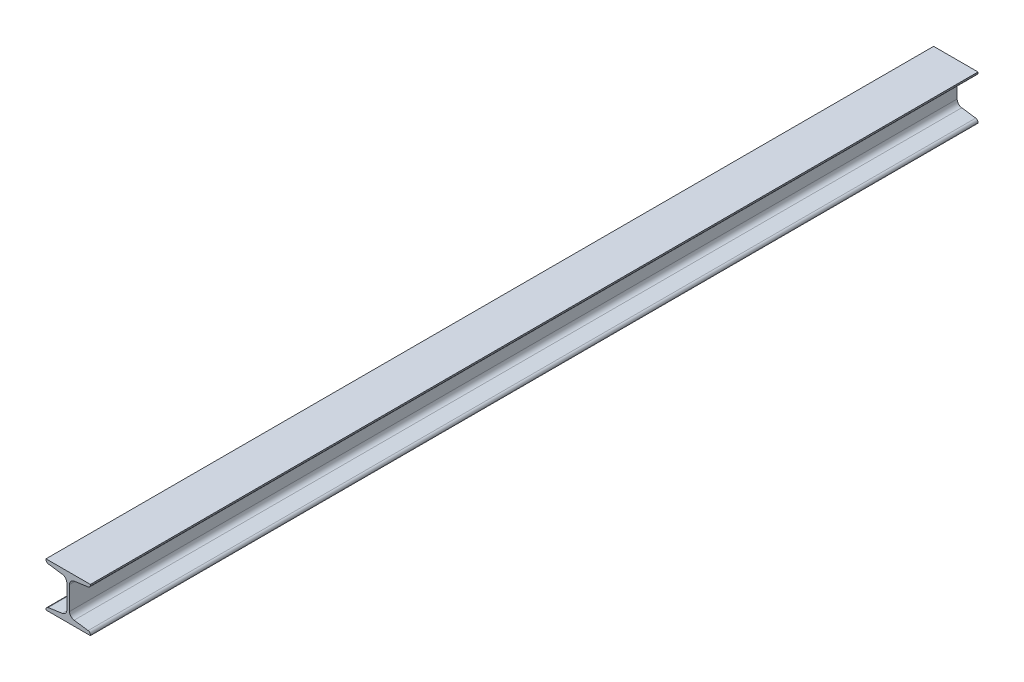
ISO-10303-21;
HEADER;
FILE_DESCRIPTION(('STEP AP214'),'2;1');
FILE_NAME('part.step','',(''),(''),'','','');
FILE_SCHEMA(('AUTOMOTIVE_DESIGN { 1 0 10303 214 1 1 1 1 }'));
ENDSEC;
DATA;
#1=APPLICATION_CONTEXT('core data for automotive mechanical design processes');
#2=APPLICATION_PROTOCOL_DEFINITION('international standard','automotive_design',2000,#1);
#3=PRODUCT_CONTEXT('',#1,'mechanical');
#4=PRODUCT('Part','Part','',(#3));
#5=PRODUCT_RELATED_PRODUCT_CATEGORY('part','',(#4));
#6=PRODUCT_DEFINITION_FORMATION('','',#4);
#7=PRODUCT_DEFINITION_CONTEXT('part definition',#1,'design');
#8=PRODUCT_DEFINITION('design','',#6,#7);
#9=PRODUCT_DEFINITION_SHAPE('','',#8);
#10=(LENGTH_UNIT() NAMED_UNIT(*) SI_UNIT(.MILLI.,.METRE.));
#11=(NAMED_UNIT(*) PLANE_ANGLE_UNIT() SI_UNIT($,.RADIAN.));
#12=(NAMED_UNIT(*) SI_UNIT($,.STERADIAN.) SOLID_ANGLE_UNIT());
#13=UNCERTAINTY_MEASURE_WITH_UNIT(LENGTH_MEASURE(1.E-05),#10,'distance_accuracy_value','');
#14=(GEOMETRIC_REPRESENTATION_CONTEXT(3) GLOBAL_UNCERTAINTY_ASSIGNED_CONTEXT((#13)) GLOBAL_UNIT_ASSIGNED_CONTEXT((#10,
#11,#12)) REPRESENTATION_CONTEXT('',''));
#15=CARTESIAN_POINT('',(0.,0.,0.));
#16=DIRECTION('',(0.,0.,1.));
#17=DIRECTION('',(1.,0.,0.));
#18=AXIS2_PLACEMENT_3D('',#15,#16,#17);
#19=CARTESIAN_POINT('',(116.713,76.2658495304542,2000.));
#20=DIRECTION('',(0.,0.,-1.));
#21=DIRECTION('',(-1.,0.,0.));
#22=AXIS2_PLACEMENT_3D('',#19,#20,#21);
#23=CYLINDRICAL_SURFACE('',#22,12.);
#24=CARTESIAN_POINT('',(116.713,76.2658495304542,0.));
#25=DIRECTION('',(0.,0.,-1.));
#26=DIRECTION('',(1.,0.,0.));
#27=AXIS2_PLACEMENT_3D('',#24,#25,#26);
#28=CIRCLE('',#27,12.);
#29=CARTESIAN_POINT('',(104.713,76.2658495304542,0.));
#30=VERTEX_POINT('',#29);
#31=CARTESIAN_POINT('',(115.042922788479,88.1490663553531,0.));
#32=VERTEX_POINT('',#31);
#33=EDGE_CURVE('E198',#30,#32,#28,.T.);
#34=ORIENTED_EDGE('',*,*,#33,.T.);
#35=DIRECTION('',(0.,0.,-1.));
#36=VECTOR('',#35,1.);
#37=CARTESIAN_POINT('',(115.042922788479,88.1490663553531,2000.));
#38=LINE('',#37,#36);
#39=CARTESIAN_POINT('',(115.042922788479,88.1490663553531,2000.));
#40=VERTEX_POINT('',#39);
#41=EDGE_CURVE('E11',#40,#32,#38,.T.);
#42=ORIENTED_EDGE('',*,*,#41,.F.);
#43=CARTESIAN_POINT('',(116.713,76.2658495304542,2000.));
#44=DIRECTION('',(0.,0.,-1.));
#45=DIRECTION('',(1.,0.,0.));
#46=AXIS2_PLACEMENT_3D('',#43,#44,#45);
#47=CIRCLE('',#46,12.);
#48=CARTESIAN_POINT('',(104.713,76.2658495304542,2000.));
#49=VERTEX_POINT('',#48);
#50=EDGE_CURVE('E236',#49,#40,#47,.T.);
#51=ORIENTED_EDGE('',*,*,#50,.F.);
#52=DIRECTION('',(0.,0.,-1.));
#53=VECTOR('',#52,1.);
#54=CARTESIAN_POINT('',(104.713,76.2658495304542,2000.));
#55=LINE('',#54,#53);
#56=EDGE_CURVE('E194',#49,#30,#55,.T.);
#57=ORIENTED_EDGE('',*,*,#56,.T.);
#58=EDGE_LOOP('',(#34,#42,#51,#57));
#59=FACE_BOUND('',#58,.T.);
#60=ADVANCED_FACE('F30',(#59),#23,.F.);
#61=CARTESIAN_POINT('',(146.54803860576,92.576821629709,2000.));
#62=DIRECTION('',(-0.139173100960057,0.990268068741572,0.));
#63=DIRECTION('',(-0.990268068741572,-0.139173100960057,0.));
#64=AXIS2_PLACEMENT_3D('',#61,#62,#63);
#65=PLANE('',#64);
#66=DIRECTION('',(0.990268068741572,0.139173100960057,0.));
#67=VECTOR('',#66,1.);
#68=CARTESIAN_POINT('',(146.54803860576,92.576821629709,0.));
#69=LINE('',#68,#67);
#70=CARTESIAN_POINT('',(146.54803860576,92.576821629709,0.));
#71=VERTEX_POINT('',#70);
#72=EDGE_CURVE('E201',#32,#71,#69,.T.);
#73=ORIENTED_EDGE('',*,*,#72,.T.);
#74=DIRECTION('',(0.,0.,-1.));
#75=VECTOR('',#74,1.);
#76=CARTESIAN_POINT('',(146.54803860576,92.576821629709,2000.));
#77=LINE('',#76,#75);
#78=CARTESIAN_POINT('',(146.54803860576,92.576821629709,2000.));
#79=VERTEX_POINT('',#78);
#80=EDGE_CURVE('E38',#79,#71,#77,.T.);
#81=ORIENTED_EDGE('',*,*,#80,.F.);
#82=DIRECTION('',(0.990268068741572,0.139173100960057,0.));
#83=VECTOR('',#82,1.);
#84=CARTESIAN_POINT('',(146.54803860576,92.576821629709,2000.));
#85=LINE('',#84,#83);
#86=EDGE_CURVE('E125',#40,#79,#85,.T.);
#87=ORIENTED_EDGE('',*,*,#86,.F.);
#88=ORIENTED_EDGE('',*,*,#41,.T.);
#89=EDGE_LOOP('',(#73,#81,#87,#88));
#90=FACE_BOUND('',#89,.T.);
#91=ADVANCED_FACE('F354',(#90),#65,.F.);
#92=CARTESIAN_POINT('',(145.713,98.5184300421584,2000.));
#93=DIRECTION('',(0.,0.,-1.));
#94=DIRECTION('',(-1.,0.,0.));
#95=AXIS2_PLACEMENT_3D('',#92,#93,#94);
#96=CYLINDRICAL_SURFACE('',#95,5.99999999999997);
#97=CARTESIAN_POINT('',(145.713,98.5184300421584,0.));
#98=DIRECTION('',(0.,0.,1.));
#99=DIRECTION('',(-1.,0.,0.));
#100=AXIS2_PLACEMENT_3D('',#97,#98,#99);
#101=CIRCLE('',#100,5.99999999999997);
#102=CARTESIAN_POINT('',(151.713,98.5184300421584,0.));
#103=VERTEX_POINT('',#102);
#104=EDGE_CURVE('E203',#71,#103,#101,.T.);
#105=ORIENTED_EDGE('',*,*,#104,.T.);
#106=DIRECTION('',(0.,0.,-1.));
#107=VECTOR('',#106,1.);
#108=CARTESIAN_POINT('',(151.713,98.5184300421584,2000.));
#109=LINE('',#108,#107);
#110=CARTESIAN_POINT('',(151.713,98.5184300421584,2000.));
#111=VERTEX_POINT('',#110);
#112=EDGE_CURVE('E279',#111,#103,#109,.T.);
#113=ORIENTED_EDGE('',*,*,#112,.F.);
#114=CARTESIAN_POINT('',(145.713,98.5184300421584,2000.));
#115=DIRECTION('',(0.,0.,1.));
#116=DIRECTION('',(-1.,0.,0.));
#117=AXIS2_PLACEMENT_3D('',#114,#115,#116);
#118=CIRCLE('',#117,5.99999999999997);
#119=EDGE_CURVE('E287',#79,#111,#118,.T.);
#120=ORIENTED_EDGE('',*,*,#119,.F.);
#121=ORIENTED_EDGE('',*,*,#80,.T.);
#122=EDGE_LOOP('',(#105,#113,#120,#121));
#123=FACE_BOUND('',#122,.T.);
#124=ADVANCED_FACE('F285',(#123),#96,.T.);
#125=CARTESIAN_POINT('',(151.713,100.,2000.));
#126=DIRECTION('',(-1.,0.,0.));
#127=DIRECTION('',(0.,0.,1.));
#128=AXIS2_PLACEMENT_3D('',#125,#126,#127);
#129=PLANE('',#128);
#130=DIRECTION('',(0.,1.,0.));
#131=VECTOR('',#130,1.);
#132=CARTESIAN_POINT('',(151.713,100.,0.));
#133=LINE('',#132,#131);
#134=CARTESIAN_POINT('',(151.713,100.,0.));
#135=VERTEX_POINT('',#134);
#136=EDGE_CURVE('E205',#103,#135,#133,.T.);
#137=ORIENTED_EDGE('',*,*,#136,.T.);
#138=DIRECTION('',(0.,0.,-1.));
#139=VECTOR('',#138,1.);
#140=CARTESIAN_POINT('',(151.713,100.,2000.));
#141=LINE('',#140,#139);
#142=CARTESIAN_POINT('',(151.713,100.,2000.));
#143=VERTEX_POINT('',#142);
#144=EDGE_CURVE('E276',#143,#135,#141,.T.);
#145=ORIENTED_EDGE('',*,*,#144,.F.);
#146=DIRECTION('',(0.,1.,0.));
#147=VECTOR('',#146,1.);
#148=CARTESIAN_POINT('',(151.713,100.,2000.));
#149=LINE('',#148,#147);
#150=EDGE_CURVE('E305',#111,#143,#149,.T.);
#151=ORIENTED_EDGE('',*,*,#150,.F.);
#152=ORIENTED_EDGE('',*,*,#112,.T.);
#153=EDGE_LOOP('',(#137,#145,#151,#152));
#154=FACE_BOUND('',#153,.T.);
#155=ADVANCED_FACE('F296',(#154),#129,.F.);
#156=CARTESIAN_POINT('',(51.713,100.,2000.));
#157=DIRECTION('',(0.,-1.,0.));
#158=DIRECTION('',(0.,0.,-1.));
#159=AXIS2_PLACEMENT_3D('',#156,#157,#158);
#160=PLANE('',#159);
#161=DIRECTION('',(-1.,0.,0.));
#162=VECTOR('',#161,1.);
#163=CARTESIAN_POINT('',(51.713,100.,0.));
#164=LINE('',#163,#162);
#165=CARTESIAN_POINT('',(51.713,100.,0.));
#166=VERTEX_POINT('',#165);
#167=EDGE_CURVE('E207',#135,#166,#164,.T.);
#168=ORIENTED_EDGE('',*,*,#167,.T.);
#169=DIRECTION('',(0.,0.,-1.));
#170=VECTOR('',#169,1.);
#171=CARTESIAN_POINT('',(51.713,100.,2000.));
#172=LINE('',#171,#170);
#173=CARTESIAN_POINT('',(51.713,100.,2000.));
#174=VERTEX_POINT('',#173);
#175=EDGE_CURVE('E273',#174,#166,#172,.T.);
#176=ORIENTED_EDGE('',*,*,#175,.F.);
#177=DIRECTION('',(-1.,0.,0.));
#178=VECTOR('',#177,1.);
#179=CARTESIAN_POINT('',(51.713,100.,2000.));
#180=LINE('',#179,#178);
#181=EDGE_CURVE('E302',#143,#174,#180,.T.);
#182=ORIENTED_EDGE('',*,*,#181,.F.);
#183=ORIENTED_EDGE('',*,*,#144,.T.);
#184=EDGE_LOOP('',(#168,#176,#182,#183));
#185=FACE_BOUND('',#184,.T.);
#186=ADVANCED_FACE('F300',(#185),#160,.F.);
#187=CARTESIAN_POINT('',(51.713,98.5184300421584,2000.));
#188=DIRECTION('',(1.,0.,0.));
#189=DIRECTION('',(0.,0.,-1.));
#190=AXIS2_PLACEMENT_3D('',#187,#188,#189);
#191=PLANE('',#190);
#192=DIRECTION('',(0.,-1.,0.));
#193=VECTOR('',#192,1.);
#194=CARTESIAN_POINT('',(51.713,98.5184300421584,0.));
#195=LINE('',#194,#193);
#196=CARTESIAN_POINT('',(51.713,98.5184300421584,0.));
#197=VERTEX_POINT('',#196);
#198=EDGE_CURVE('E209',#166,#197,#195,.T.);
#199=ORIENTED_EDGE('',*,*,#198,.T.);
#200=DIRECTION('',(0.,0.,-1.));
#201=VECTOR('',#200,1.);
#202=CARTESIAN_POINT('',(51.713,98.5184300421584,2000.));
#203=LINE('',#202,#201);
#204=CARTESIAN_POINT('',(51.713,98.5184300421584,2000.));
#205=VERTEX_POINT('',#204);
#206=EDGE_CURVE('E270',#205,#197,#203,.T.);
#207=ORIENTED_EDGE('',*,*,#206,.F.);
#208=DIRECTION('',(0.,-1.,0.));
#209=VECTOR('',#208,1.);
#210=CARTESIAN_POINT('',(51.713,98.5184300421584,2000.));
#211=LINE('',#210,#209);
#212=EDGE_CURVE('E304',#174,#205,#211,.T.);
#213=ORIENTED_EDGE('',*,*,#212,.F.);
#214=ORIENTED_EDGE('',*,*,#175,.T.);
#215=EDGE_LOOP('',(#199,#207,#213,#214));
#216=FACE_BOUND('',#215,.T.);
#217=ADVANCED_FACE('F367',(#216),#191,.F.);
#218=CARTESIAN_POINT('',(57.713,98.5184300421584,2000.));
#219=DIRECTION('',(0.,0.,-1.));
#220=DIRECTION('',(-1.,0.,0.));
#221=AXIS2_PLACEMENT_3D('',#218,#219,#220);
#222=CYLINDRICAL_SURFACE('',#221,5.99999999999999);
#223=CARTESIAN_POINT('',(57.713,98.5184300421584,0.));
#224=DIRECTION('',(0.,0.,1.));
#225=DIRECTION('',(1.,0.,0.));
#226=AXIS2_PLACEMENT_3D('',#223,#224,#225);
#227=CIRCLE('',#226,5.99999999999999);
#228=CARTESIAN_POINT('',(56.8779613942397,92.576821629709,0.));
#229=VERTEX_POINT('',#228);
#230=EDGE_CURVE('E211',#197,#229,#227,.T.);
#231=ORIENTED_EDGE('',*,*,#230,.T.);
#232=DIRECTION('',(0.,0.,-1.));
#233=VECTOR('',#232,1.);
#234=CARTESIAN_POINT('',(56.8779613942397,92.576821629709,2000.));
#235=LINE('',#234,#233);
#236=CARTESIAN_POINT('',(56.8779613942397,92.576821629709,2000.));
#237=VERTEX_POINT('',#236);
#238=EDGE_CURVE('E267',#237,#229,#235,.T.);
#239=ORIENTED_EDGE('',*,*,#238,.F.);
#240=CARTESIAN_POINT('',(57.713,98.5184300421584,2000.));
#241=DIRECTION('',(0.,0.,1.));
#242=DIRECTION('',(1.,0.,0.));
#243=AXIS2_PLACEMENT_3D('',#240,#241,#242);
#244=CIRCLE('',#243,5.99999999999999);
#245=EDGE_CURVE('E307',#205,#237,#244,.T.);
#246=ORIENTED_EDGE('',*,*,#245,.F.);
#247=ORIENTED_EDGE('',*,*,#206,.T.);
#248=EDGE_LOOP('',(#231,#239,#246,#247));
#249=FACE_BOUND('',#248,.T.);
#250=ADVANCED_FACE('F370',(#249),#222,.T.);
#251=CARTESIAN_POINT('',(88.3830772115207,88.1490663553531,2000.));
#252=DIRECTION('',(0.139173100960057,0.990268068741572,0.));
#253=DIRECTION('',(-0.990268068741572,0.139173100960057,0.));
#254=AXIS2_PLACEMENT_3D('',#251,#252,#253);
#255=PLANE('',#254);
#256=DIRECTION('',(0.990268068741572,-0.139173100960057,0.));
#257=VECTOR('',#256,1.);
#258=CARTESIAN_POINT('',(88.3830772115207,88.1490663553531,0.));
#259=LINE('',#258,#257);
#260=CARTESIAN_POINT('',(88.3830772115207,88.1490663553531,0.));
#261=VERTEX_POINT('',#260);
#262=EDGE_CURVE('E213',#229,#261,#259,.T.);
#263=ORIENTED_EDGE('',*,*,#262,.T.);
#264=DIRECTION('',(0.,0.,-1.));
#265=VECTOR('',#264,1.);
#266=CARTESIAN_POINT('',(88.3830772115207,88.1490663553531,2000.));
#267=LINE('',#266,#265);
#268=CARTESIAN_POINT('',(88.3830772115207,88.1490663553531,2000.));
#269=VERTEX_POINT('',#268);
#270=EDGE_CURVE('E264',#269,#261,#267,.T.);
#271=ORIENTED_EDGE('',*,*,#270,.F.);
#272=DIRECTION('',(0.990268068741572,-0.139173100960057,0.));
#273=VECTOR('',#272,1.);
#274=CARTESIAN_POINT('',(88.3830772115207,88.1490663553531,2000.));
#275=LINE('',#274,#273);
#276=EDGE_CURVE('E313',#237,#269,#275,.T.);
#277=ORIENTED_EDGE('',*,*,#276,.F.);
#278=ORIENTED_EDGE('',*,*,#238,.T.);
#279=EDGE_LOOP('',(#263,#271,#277,#278));
#280=FACE_BOUND('',#279,.T.);
#281=ADVANCED_FACE('F374',(#280),#255,.F.);
#282=CARTESIAN_POINT('',(86.713,76.2658495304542,2000.));
#283=DIRECTION('',(0.,0.,-1.));
#284=DIRECTION('',(-1.,0.,0.));
#285=AXIS2_PLACEMENT_3D('',#282,#283,#284);
#286=CYLINDRICAL_SURFACE('',#285,12.);
#287=CARTESIAN_POINT('',(86.713,76.2658495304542,0.));
#288=DIRECTION('',(0.,0.,-1.));
#289=DIRECTION('',(1.,0.,0.));
#290=AXIS2_PLACEMENT_3D('',#287,#288,#289);
#291=CIRCLE('',#290,12.);
#292=CARTESIAN_POINT('',(98.713,76.2658495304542,0.));
#293=VERTEX_POINT('',#292);
#294=EDGE_CURVE('E215',#261,#293,#291,.T.);
#295=ORIENTED_EDGE('',*,*,#294,.T.);
#296=DIRECTION('',(0.,0.,-1.));
#297=VECTOR('',#296,1.);
#298=CARTESIAN_POINT('',(98.713,76.2658495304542,2000.));
#299=LINE('',#298,#297);
#300=CARTESIAN_POINT('',(98.713,76.2658495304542,2000.));
#301=VERTEX_POINT('',#300);
#302=EDGE_CURVE('E261',#301,#293,#299,.T.);
#303=ORIENTED_EDGE('',*,*,#302,.F.);
#304=CARTESIAN_POINT('',(86.713,76.2658495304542,2000.));
#305=DIRECTION('',(0.,0.,-1.));
#306=DIRECTION('',(1.,0.,0.));
#307=AXIS2_PLACEMENT_3D('',#304,#305,#306);
#308=CIRCLE('',#307,12.);
#309=EDGE_CURVE('E315',#269,#301,#308,.T.);
#310=ORIENTED_EDGE('',*,*,#309,.F.);
#311=ORIENTED_EDGE('',*,*,#270,.T.);
#312=EDGE_LOOP('',(#295,#303,#310,#311));
#313=FACE_BOUND('',#312,.T.);
#314=ADVANCED_FACE('F378',(#313),#286,.F.);
#315=CARTESIAN_POINT('',(98.713,23.7341504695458,2000.));
#316=DIRECTION('',(1.,0.,0.));
#317=DIRECTION('',(0.,0.,-1.));
#318=AXIS2_PLACEMENT_3D('',#315,#316,#317);
#319=PLANE('',#318);
#320=DIRECTION('',(0.,-1.,0.));
#321=VECTOR('',#320,1.);
#322=CARTESIAN_POINT('',(98.713,23.7341504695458,0.));
#323=LINE('',#322,#321);
#324=CARTESIAN_POINT('',(98.713,23.7341504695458,0.));
#325=VERTEX_POINT('',#324);
#326=EDGE_CURVE('E217',#293,#325,#323,.T.);
#327=ORIENTED_EDGE('',*,*,#326,.T.);
#328=DIRECTION('',(0.,0.,-1.));
#329=VECTOR('',#328,1.);
#330=CARTESIAN_POINT('',(98.713,23.7341504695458,2000.));
#331=LINE('',#330,#329);
#332=CARTESIAN_POINT('',(98.713,23.7341504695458,2000.));
#333=VERTEX_POINT('',#332);
#334=EDGE_CURVE('E258',#333,#325,#331,.T.);
#335=ORIENTED_EDGE('',*,*,#334,.F.);
#336=DIRECTION('',(0.,-1.,0.));
#337=VECTOR('',#336,1.);
#338=CARTESIAN_POINT('',(98.713,23.7341504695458,2000.));
#339=LINE('',#338,#337);
#340=EDGE_CURVE('E317',#301,#333,#339,.T.);
#341=ORIENTED_EDGE('',*,*,#340,.F.);
#342=ORIENTED_EDGE('',*,*,#302,.T.);
#343=EDGE_LOOP('',(#327,#335,#341,#342));
#344=FACE_BOUND('',#343,.T.);
#345=ADVANCED_FACE('F382',(#344),#319,.F.);
#346=CARTESIAN_POINT('',(86.713,23.7341504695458,2000.));
#347=DIRECTION('',(0.,0.,-1.));
#348=DIRECTION('',(-1.,0.,0.));
#349=AXIS2_PLACEMENT_3D('',#346,#347,#348);
#350=CYLINDRICAL_SURFACE('',#349,12.);
#351=CARTESIAN_POINT('',(86.713,23.7341504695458,0.));
#352=DIRECTION('',(0.,0.,-1.));
#353=DIRECTION('',(1.,0.,0.));
#354=AXIS2_PLACEMENT_3D('',#351,#352,#353);
#355=CIRCLE('',#354,12.);
#356=CARTESIAN_POINT('',(88.3830772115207,11.8509336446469,0.));
#357=VERTEX_POINT('',#356);
#358=EDGE_CURVE('E219',#325,#357,#355,.T.);
#359=ORIENTED_EDGE('',*,*,#358,.T.);
#360=DIRECTION('',(0.,0.,-1.));
#361=VECTOR('',#360,1.);
#362=CARTESIAN_POINT('',(88.3830772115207,11.8509336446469,2000.));
#363=LINE('',#362,#361);
#364=CARTESIAN_POINT('',(88.3830772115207,11.8509336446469,2000.));
#365=VERTEX_POINT('',#364);
#366=EDGE_CURVE('E255',#365,#357,#363,.T.);
#367=ORIENTED_EDGE('',*,*,#366,.F.);
#368=CARTESIAN_POINT('',(86.713,23.7341504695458,2000.));
#369=DIRECTION('',(0.,0.,-1.));
#370=DIRECTION('',(1.,0.,0.));
#371=AXIS2_PLACEMENT_3D('',#368,#369,#370);
#372=CIRCLE('',#371,12.);
#373=EDGE_CURVE('E319',#333,#365,#372,.T.);
#374=ORIENTED_EDGE('',*,*,#373,.F.);
#375=ORIENTED_EDGE('',*,*,#334,.T.);
#376=EDGE_LOOP('',(#359,#367,#374,#375));
#377=FACE_BOUND('',#376,.T.);
#378=ADVANCED_FACE('F386',(#377),#350,.F.);
#379=CARTESIAN_POINT('',(56.8779613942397,7.42317837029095,2000.));
#380=DIRECTION('',(0.139173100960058,-0.990268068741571,0.));
#381=DIRECTION('',(0.990268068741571,0.139173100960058,0.));
#382=AXIS2_PLACEMENT_3D('',#379,#380,#381);
#383=PLANE('',#382);
#384=DIRECTION('',(-0.990268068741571,-0.139173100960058,0.));
#385=VECTOR('',#384,1.);
#386=CARTESIAN_POINT('',(56.8779613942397,7.42317837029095,0.));
#387=LINE('',#386,#385);
#388=CARTESIAN_POINT('',(56.8779613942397,7.42317837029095,0.));
#389=VERTEX_POINT('',#388);
#390=EDGE_CURVE('E221',#357,#389,#387,.T.);
#391=ORIENTED_EDGE('',*,*,#390,.T.);
#392=DIRECTION('',(0.,0.,-1.));
#393=VECTOR('',#392,1.);
#394=CARTESIAN_POINT('',(56.8779613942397,7.42317837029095,2000.));
#395=LINE('',#394,#393);
#396=CARTESIAN_POINT('',(56.8779613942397,7.42317837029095,2000.));
#397=VERTEX_POINT('',#396);
#398=EDGE_CURVE('E252',#397,#389,#395,.T.);
#399=ORIENTED_EDGE('',*,*,#398,.F.);
#400=DIRECTION('',(-0.990268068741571,-0.139173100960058,0.));
#401=VECTOR('',#400,1.);
#402=CARTESIAN_POINT('',(56.8779613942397,7.42317837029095,2000.));
#403=LINE('',#402,#401);
#404=EDGE_CURVE('E321',#365,#397,#403,.T.);
#405=ORIENTED_EDGE('',*,*,#404,.F.);
#406=ORIENTED_EDGE('',*,*,#366,.T.);
#407=EDGE_LOOP('',(#391,#399,#405,#406));
#408=FACE_BOUND('',#407,.T.);
#409=ADVANCED_FACE('F390',(#408),#383,.F.);
#410=CARTESIAN_POINT('',(57.713,1.48156995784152,2000.));
#411=DIRECTION('',(0.,0.,-1.));
#412=DIRECTION('',(-1.,0.,0.));
#413=AXIS2_PLACEMENT_3D('',#410,#411,#412);
#414=CYLINDRICAL_SURFACE('',#413,6.);
#415=CARTESIAN_POINT('',(57.713,1.48156995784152,0.));
#416=DIRECTION('',(0.,0.,1.));
#417=DIRECTION('',(-1.,0.,0.));
#418=AXIS2_PLACEMENT_3D('',#415,#416,#417);
#419=CIRCLE('',#418,6.);
#420=CARTESIAN_POINT('',(51.713,1.48156995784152,0.));
#421=VERTEX_POINT('',#420);
#422=EDGE_CURVE('E223',#389,#421,#419,.T.);
#423=ORIENTED_EDGE('',*,*,#422,.T.);
#424=DIRECTION('',(0.,0.,-1.));
#425=VECTOR('',#424,1.);
#426=CARTESIAN_POINT('',(51.713,1.48156995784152,2000.));
#427=LINE('',#426,#425);
#428=CARTESIAN_POINT('',(51.713,1.48156995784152,2000.));
#429=VERTEX_POINT('',#428);
#430=EDGE_CURVE('E249',#429,#421,#427,.T.);
#431=ORIENTED_EDGE('',*,*,#430,.F.);
#432=CARTESIAN_POINT('',(57.713,1.48156995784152,2000.));
#433=DIRECTION('',(0.,0.,1.));
#434=DIRECTION('',(-1.,0.,0.));
#435=AXIS2_PLACEMENT_3D('',#432,#433,#434);
#436=CIRCLE('',#435,6.);
#437=EDGE_CURVE('E323',#397,#429,#436,.T.);
#438=ORIENTED_EDGE('',*,*,#437,.F.);
#439=ORIENTED_EDGE('',*,*,#398,.T.);
#440=EDGE_LOOP('',(#423,#431,#438,#439));
#441=FACE_BOUND('',#440,.T.);
#442=ADVANCED_FACE('F394',(#441),#414,.T.);
#443=CARTESIAN_POINT('',(51.713,0.,2000.));
#444=DIRECTION('',(1.,0.,0.));
#445=DIRECTION('',(0.,0.,-1.));
#446=AXIS2_PLACEMENT_3D('',#443,#444,#445);
#447=PLANE('',#446);
#448=DIRECTION('',(0.,-1.,0.));
#449=VECTOR('',#448,1.);
#450=CARTESIAN_POINT('',(51.713,0.,0.));
#451=LINE('',#450,#449);
#452=CARTESIAN_POINT('',(51.713,0.,0.));
#453=VERTEX_POINT('',#452);
#454=EDGE_CURVE('E225',#421,#453,#451,.T.);
#455=ORIENTED_EDGE('',*,*,#454,.T.);
#456=DIRECTION('',(0.,0.,-1.));
#457=VECTOR('',#456,1.);
#458=CARTESIAN_POINT('',(51.713,0.,2000.));
#459=LINE('',#458,#457);
#460=CARTESIAN_POINT('',(51.713,0.,2000.));
#461=VERTEX_POINT('',#460);
#462=EDGE_CURVE('E246',#461,#453,#459,.T.);
#463=ORIENTED_EDGE('',*,*,#462,.F.);
#464=DIRECTION('',(0.,-1.,0.));
#465=VECTOR('',#464,1.);
#466=CARTESIAN_POINT('',(51.713,0.,2000.));
#467=LINE('',#466,#465);
#468=EDGE_CURVE('E325',#429,#461,#467,.T.);
#469=ORIENTED_EDGE('',*,*,#468,.F.);
#470=ORIENTED_EDGE('',*,*,#430,.T.);
#471=EDGE_LOOP('',(#455,#463,#469,#470));
#472=FACE_BOUND('',#471,.T.);
#473=ADVANCED_FACE('F398',(#472),#447,.F.);
#474=CARTESIAN_POINT('',(151.713,0.,2000.));
#475=DIRECTION('',(0.,1.,0.));
#476=DIRECTION('',(0.,0.,1.));
#477=AXIS2_PLACEMENT_3D('',#474,#475,#476);
#478=PLANE('',#477);
#479=DIRECTION('',(1.,0.,0.));
#480=VECTOR('',#479,1.);
#481=CARTESIAN_POINT('',(151.713,0.,0.));
#482=LINE('',#481,#480);
#483=CARTESIAN_POINT('',(151.713,0.,0.));
#484=VERTEX_POINT('',#483);
#485=EDGE_CURVE('E227',#453,#484,#482,.T.);
#486=ORIENTED_EDGE('',*,*,#485,.T.);
#487=DIRECTION('',(0.,0.,-1.));
#488=VECTOR('',#487,1.);
#489=CARTESIAN_POINT('',(151.713,0.,2000.));
#490=LINE('',#489,#488);
#491=CARTESIAN_POINT('',(151.713,0.,2000.));
#492=VERTEX_POINT('',#491);
#493=EDGE_CURVE('E243',#492,#484,#490,.T.);
#494=ORIENTED_EDGE('',*,*,#493,.F.);
#495=DIRECTION('',(1.,0.,0.));
#496=VECTOR('',#495,1.);
#497=CARTESIAN_POINT('',(151.713,0.,2000.));
#498=LINE('',#497,#496);
#499=EDGE_CURVE('E327',#461,#492,#498,.T.);
#500=ORIENTED_EDGE('',*,*,#499,.F.);
#501=ORIENTED_EDGE('',*,*,#462,.T.);
#502=EDGE_LOOP('',(#486,#494,#500,#501));
#503=FACE_BOUND('',#502,.T.);
#504=ADVANCED_FACE('F402',(#503),#478,.F.);
#505=CARTESIAN_POINT('',(151.713,1.48156995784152,2000.));
#506=DIRECTION('',(-1.,0.,0.));
#507=DIRECTION('',(0.,0.,1.));
#508=AXIS2_PLACEMENT_3D('',#505,#506,#507);
#509=PLANE('',#508);
#510=DIRECTION('',(0.,1.,0.));
#511=VECTOR('',#510,1.);
#512=CARTESIAN_POINT('',(151.713,1.48156995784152,0.));
#513=LINE('',#512,#511);
#514=CARTESIAN_POINT('',(151.713,1.48156995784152,0.));
#515=VERTEX_POINT('',#514);
#516=EDGE_CURVE('E229',#484,#515,#513,.T.);
#517=ORIENTED_EDGE('',*,*,#516,.T.);
#518=DIRECTION('',(0.,0.,-1.));
#519=VECTOR('',#518,1.);
#520=CARTESIAN_POINT('',(151.713,1.48156995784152,2000.));
#521=LINE('',#520,#519);
#522=CARTESIAN_POINT('',(151.713,1.48156995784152,2000.));
#523=VERTEX_POINT('',#522);
#524=EDGE_CURVE('E240',#523,#515,#521,.T.);
#525=ORIENTED_EDGE('',*,*,#524,.F.);
#526=DIRECTION('',(0.,1.,0.));
#527=VECTOR('',#526,1.);
#528=CARTESIAN_POINT('',(151.713,1.48156995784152,2000.));
#529=LINE('',#528,#527);
#530=EDGE_CURVE('E329',#492,#523,#529,.T.);
#531=ORIENTED_EDGE('',*,*,#530,.F.);
#532=ORIENTED_EDGE('',*,*,#493,.T.);
#533=EDGE_LOOP('',(#517,#525,#531,#532));
#534=FACE_BOUND('',#533,.T.);
#535=ADVANCED_FACE('F335',(#534),#509,.F.);
#536=CARTESIAN_POINT('',(145.713,1.48156995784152,2000.));
#537=DIRECTION('',(0.,0.,-1.));
#538=DIRECTION('',(-1.,0.,0.));
#539=AXIS2_PLACEMENT_3D('',#536,#537,#538);
#540=CYLINDRICAL_SURFACE('',#539,5.99999999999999);
#541=CARTESIAN_POINT('',(145.713,1.48156995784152,0.));
#542=DIRECTION('',(0.,0.,1.));
#543=DIRECTION('',(1.,0.,0.));
#544=AXIS2_PLACEMENT_3D('',#541,#542,#543);
#545=CIRCLE('',#544,5.99999999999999);
#546=CARTESIAN_POINT('',(146.54803860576,7.42317837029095,0.));
#547=VERTEX_POINT('',#546);
#548=EDGE_CURVE('E231',#515,#547,#545,.T.);
#549=ORIENTED_EDGE('',*,*,#548,.T.);
#550=DIRECTION('',(0.,0.,-1.));
#551=VECTOR('',#550,1.);
#552=CARTESIAN_POINT('',(146.54803860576,7.42317837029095,2000.));
#553=LINE('',#552,#551);
#554=CARTESIAN_POINT('',(146.54803860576,7.42317837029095,2000.));
#555=VERTEX_POINT('',#554);
#556=EDGE_CURVE('E189',#555,#547,#553,.T.);
#557=ORIENTED_EDGE('',*,*,#556,.F.);
#558=CARTESIAN_POINT('',(145.713,1.48156995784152,2000.));
#559=DIRECTION('',(0.,0.,1.));
#560=DIRECTION('',(1.,0.,0.));
#561=AXIS2_PLACEMENT_3D('',#558,#559,#560);
#562=CIRCLE('',#561,5.99999999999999);
#563=EDGE_CURVE('E180',#523,#555,#562,.T.);
#564=ORIENTED_EDGE('',*,*,#563,.F.);
#565=ORIENTED_EDGE('',*,*,#524,.T.);
#566=EDGE_LOOP('',(#549,#557,#564,#565));
#567=FACE_BOUND('',#566,.T.);
#568=ADVANCED_FACE('F339',(#567),#540,.T.);
#569=CARTESIAN_POINT('',(115.042922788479,11.8509336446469,2000.));
#570=DIRECTION('',(-0.139173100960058,-0.990268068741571,0.));
#571=DIRECTION('',(0.990268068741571,-0.139173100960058,0.));
#572=AXIS2_PLACEMENT_3D('',#569,#570,#571);
#573=PLANE('',#572);
#574=DIRECTION('',(-0.990268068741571,0.139173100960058,0.));
#575=VECTOR('',#574,1.);
#576=CARTESIAN_POINT('',(115.042922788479,11.8509336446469,0.));
#577=LINE('',#576,#575);
#578=CARTESIAN_POINT('',(115.042922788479,11.8509336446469,0.));
#579=VERTEX_POINT('',#578);
#580=EDGE_CURVE('E188',#547,#579,#577,.T.);
#581=ORIENTED_EDGE('',*,*,#580,.T.);
#582=DIRECTION('',(0.,0.,-1.));
#583=VECTOR('',#582,1.);
#584=CARTESIAN_POINT('',(115.042922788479,11.8509336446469,2000.));
#585=LINE('',#584,#583);
#586=CARTESIAN_POINT('',(115.042922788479,11.8509336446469,2000.));
#587=VERTEX_POINT('',#586);
#588=EDGE_CURVE('E185',#587,#579,#585,.T.);
#589=ORIENTED_EDGE('',*,*,#588,.F.);
#590=DIRECTION('',(-0.990268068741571,0.139173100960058,0.));
#591=VECTOR('',#590,1.);
#592=CARTESIAN_POINT('',(115.042922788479,11.8509336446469,2000.));
#593=LINE('',#592,#591);
#594=EDGE_CURVE('E174',#555,#587,#593,.T.);
#595=ORIENTED_EDGE('',*,*,#594,.F.);
#596=ORIENTED_EDGE('',*,*,#556,.T.);
#597=EDGE_LOOP('',(#581,#589,#595,#596));
#598=FACE_BOUND('',#597,.T.);
#599=ADVANCED_FACE('F186',(#598),#573,.F.);
#600=CARTESIAN_POINT('',(116.713,23.7341504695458,2000.));
#601=DIRECTION('',(0.,0.,-1.));
#602=DIRECTION('',(-1.,0.,0.));
#603=AXIS2_PLACEMENT_3D('',#600,#601,#602);
#604=CYLINDRICAL_SURFACE('',#603,12.);
#605=CARTESIAN_POINT('',(116.713,23.7341504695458,0.));
#606=DIRECTION('',(0.,0.,-1.));
#607=DIRECTION('',(1.,0.,0.));
#608=AXIS2_PLACEMENT_3D('',#605,#606,#607);
#609=CIRCLE('',#608,12.);
#610=CARTESIAN_POINT('',(104.713,23.7341504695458,0.));
#611=VERTEX_POINT('',#610);
#612=EDGE_CURVE('E111',#579,#611,#609,.T.);
#613=ORIENTED_EDGE('',*,*,#612,.T.);
#614=DIRECTION('',(0.,0.,-1.));
#615=VECTOR('',#614,1.);
#616=CARTESIAN_POINT('',(104.713,23.7341504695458,2000.));
#617=LINE('',#616,#615);
#618=CARTESIAN_POINT('',(104.713,23.7341504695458,2000.));
#619=VERTEX_POINT('',#618);
#620=EDGE_CURVE('E190',#619,#611,#617,.T.);
#621=ORIENTED_EDGE('',*,*,#620,.F.);
#622=CARTESIAN_POINT('',(116.713,23.7341504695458,2000.));
#623=DIRECTION('',(0.,0.,-1.));
#624=DIRECTION('',(1.,0.,0.));
#625=AXIS2_PLACEMENT_3D('',#622,#623,#624);
#626=CIRCLE('',#625,12.);
#627=EDGE_CURVE('E178',#587,#619,#626,.T.);
#628=ORIENTED_EDGE('',*,*,#627,.F.);
#629=ORIENTED_EDGE('',*,*,#588,.T.);
#630=EDGE_LOOP('',(#613,#621,#628,#629));
#631=FACE_BOUND('',#630,.T.);
#632=ADVANCED_FACE('F192',(#631),#604,.F.);
#633=CARTESIAN_POINT('',(104.713,76.2658495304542,2000.));
#634=DIRECTION('',(-1.,0.,0.));
#635=DIRECTION('',(0.,0.,1.));
#636=AXIS2_PLACEMENT_3D('',#633,#634,#635);
#637=PLANE('',#636);
#638=DIRECTION('',(0.,1.,0.));
#639=VECTOR('',#638,1.);
#640=CARTESIAN_POINT('',(104.713,76.2658495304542,0.));
#641=LINE('',#640,#639);
#642=EDGE_CURVE('E117',#611,#30,#641,.T.);
#643=ORIENTED_EDGE('',*,*,#642,.T.);
#644=ORIENTED_EDGE('',*,*,#56,.F.);
#645=DIRECTION('',(0.,1.,0.));
#646=VECTOR('',#645,1.);
#647=CARTESIAN_POINT('',(104.713,76.2658495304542,2000.));
#648=LINE('',#647,#646);
#649=EDGE_CURVE('E46',#619,#49,#648,.T.);
#650=ORIENTED_EDGE('',*,*,#649,.F.);
#651=ORIENTED_EDGE('',*,*,#620,.T.);
#652=EDGE_LOOP('',(#643,#644,#650,#651));
#653=FACE_BOUND('',#652,.T.);
#654=ADVANCED_FACE('F343',(#653),#637,.F.);
#655=CARTESIAN_POINT('',(116.713,76.2658495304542,2000.));
#656=DIRECTION('',(0.,0.,1.));
#657=DIRECTION('',(1.,0.,0.));
#658=AXIS2_PLACEMENT_3D('',#655,#656,#657);
#659=PLANE('',#658);
#660=ORIENTED_EDGE('',*,*,#50,.T.);
#661=ORIENTED_EDGE('',*,*,#86,.T.);
#662=ORIENTED_EDGE('',*,*,#119,.T.);
#663=ORIENTED_EDGE('',*,*,#150,.T.);
#664=ORIENTED_EDGE('',*,*,#181,.T.);
#665=ORIENTED_EDGE('',*,*,#212,.T.);
#666=ORIENTED_EDGE('',*,*,#245,.T.);
#667=ORIENTED_EDGE('',*,*,#276,.T.);
#668=ORIENTED_EDGE('',*,*,#309,.T.);
#669=ORIENTED_EDGE('',*,*,#340,.T.);
#670=ORIENTED_EDGE('',*,*,#373,.T.);
#671=ORIENTED_EDGE('',*,*,#404,.T.);
#672=ORIENTED_EDGE('',*,*,#437,.T.);
#673=ORIENTED_EDGE('',*,*,#468,.T.);
#674=ORIENTED_EDGE('',*,*,#499,.T.);
#675=ORIENTED_EDGE('',*,*,#530,.T.);
#676=ORIENTED_EDGE('',*,*,#563,.T.);
#677=ORIENTED_EDGE('',*,*,#594,.T.);
#678=ORIENTED_EDGE('',*,*,#627,.T.);
#679=ORIENTED_EDGE('',*,*,#649,.T.);
#680=EDGE_LOOP('',(#660,#661,#662,#663,#664,#665,#666,#667,#668,#669,#670,#671,#672,#673,#674,
#675,#676,#677,#678,#679));
#681=FACE_BOUND('',#680,.T.);
#682=ADVANCED_FACE('F176',(#681),#659,.T.);
#683=CARTESIAN_POINT('',(116.713,76.2658495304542,0.));
#684=DIRECTION('',(0.,0.,1.));
#685=DIRECTION('',(1.,0.,0.));
#686=AXIS2_PLACEMENT_3D('',#683,#684,#685);
#687=PLANE('',#686);
#688=ORIENTED_EDGE('',*,*,#33,.F.);
#689=ORIENTED_EDGE('',*,*,#642,.F.);
#690=ORIENTED_EDGE('',*,*,#612,.F.);
#691=ORIENTED_EDGE('',*,*,#580,.F.);
#692=ORIENTED_EDGE('',*,*,#548,.F.);
#693=ORIENTED_EDGE('',*,*,#516,.F.);
#694=ORIENTED_EDGE('',*,*,#485,.F.);
#695=ORIENTED_EDGE('',*,*,#454,.F.);
#696=ORIENTED_EDGE('',*,*,#422,.F.);
#697=ORIENTED_EDGE('',*,*,#390,.F.);
#698=ORIENTED_EDGE('',*,*,#358,.F.);
#699=ORIENTED_EDGE('',*,*,#326,.F.);
#700=ORIENTED_EDGE('',*,*,#294,.F.);
#701=ORIENTED_EDGE('',*,*,#262,.F.);
#702=ORIENTED_EDGE('',*,*,#230,.F.);
#703=ORIENTED_EDGE('',*,*,#198,.F.);
#704=ORIENTED_EDGE('',*,*,#167,.F.);
#705=ORIENTED_EDGE('',*,*,#136,.F.);
#706=ORIENTED_EDGE('',*,*,#104,.F.);
#707=ORIENTED_EDGE('',*,*,#72,.F.);
#708=EDGE_LOOP('',(#688,#689,#690,#691,#692,#693,#694,#695,#696,#697,#698,#699,#700,#701,#702,
#703,#704,#705,#706,#707));
#709=FACE_BOUND('',#708,.T.);
#710=ADVANCED_FACE('F291',(#709),#687,.F.);
#711=CLOSED_SHELL('',(#60,#91,#124,#155,#186,#217,#250,#281,#314,#345,#378,#409,#442,#473,#504,
#535,#568,#599,#632,#654,#682,#710));
#712=MANIFOLD_SOLID_BREP('B2',#711);
#713=ADVANCED_BREP_SHAPE_REPRESENTATION('',(#18,#712),#14);
#714=SHAPE_DEFINITION_REPRESENTATION(#9,#713);
ENDSEC;
END-ISO-10303-21;
